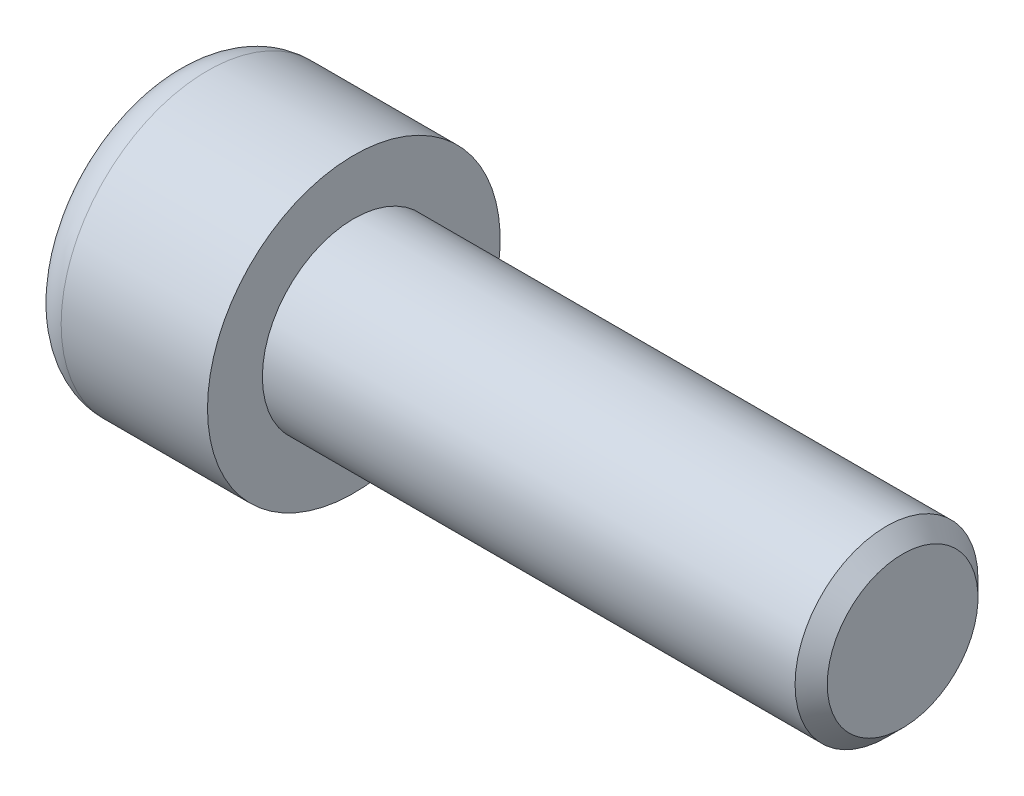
from build123d import *

# Parameters (mm, degrees)
CHANFREIN2_SIZE         = 0.88
ENL_V_MAT_EXTRU_1_DEPTH = 9
CONG_1_R                = 2


with BuildPart() as part:
    # Esquisse1 → Base-R_volution (revolve)
    with BuildSketch(Plane.XY, mode=Mode.PRIVATE) as base_r_volution_sk:
        Polygon((-12, 0), (-12, 8), (-2, 8), (-2, 5), (28, 5), (28, 0), align=None)
    revolve(base_r_volution_sk.sketch.rotate(Axis((-18.865021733, 0, 0), (1, 0, 0)), 90), axis=Axis((-18.865021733, 0, 0), (1, 0, 0)))

    # Chanfrein2
    chanfrein2_edges = [part.edges().sort_by_distance(p)[0] for p in [
        (28, 0, -5),
    ]]
    chamfer(chanfrein2_edges, length=CHANFREIN2_SIZE)

    # Esquisse2 → Enl_v. mat.-Extru.1 (cut)
    with BuildSketch(Plane.ZY.offset(12)):
        Polygon((0, 4.618802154), (4, 2.309401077), (4, -2.309401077), (0, -4.618802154), (-4, -2.309401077), (-4, 2.309401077), align=None)
    extrude(amount=-ENL_V_MAT_EXTRU_1_DEPTH, mode=Mode.SUBTRACT)

    # Cong_1
    cong_1_edges = [part.edges().sort_by_distance(p)[0] for p in [
        (-12, 0, -8),
    ]]
    fillet(cong_1_edges, radius=CONG_1_R)


solid = part.part
